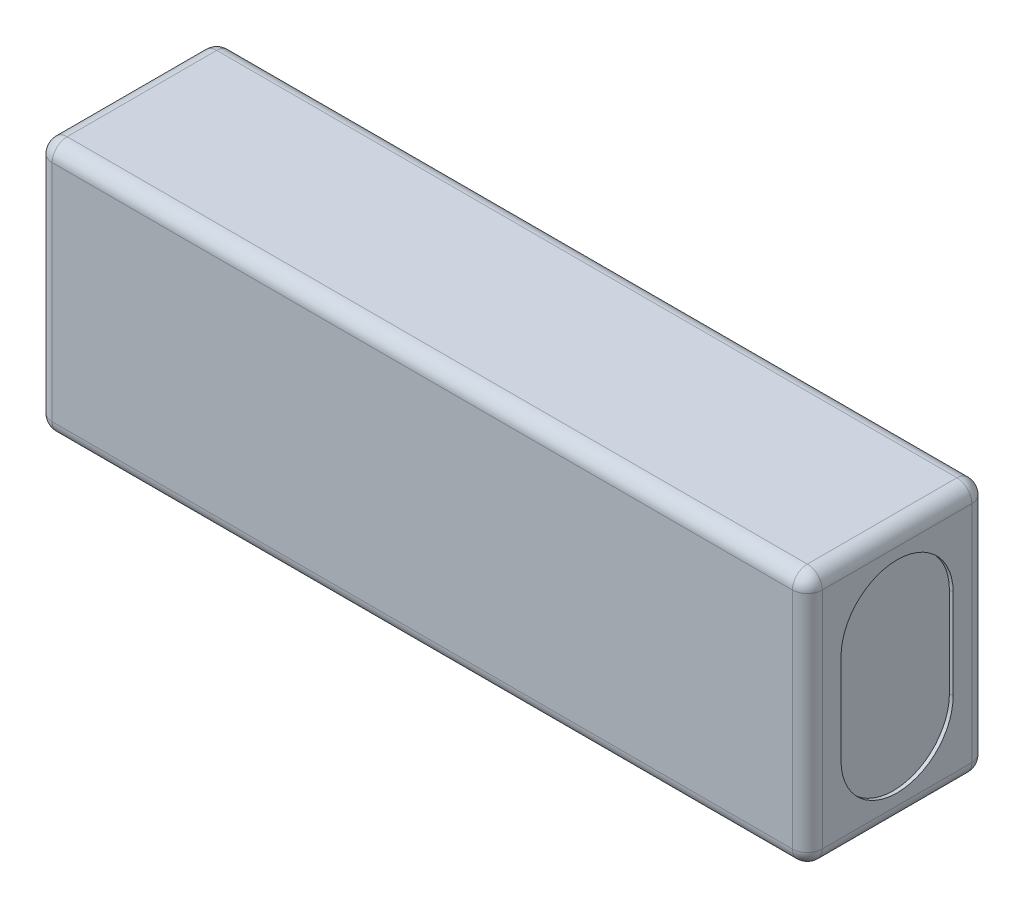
from build123d import *

# Parameters (mm, degrees)
ESBO_O1_W                = 103
ESBO_O1_H                = 34
RESSALTO_EXTRUS_O1_DEPTH = 24
CORTE_EXTRUS_O1_DEPTH    = 0.5
FILETE1_R                = 2


with BuildPart() as part:
    # Esbo_o1 → Ressalto-extrus_o1 (new body)
    with BuildSketch(Plane.XY):
        Rectangle(ESBO_O1_W, ESBO_O1_H)
    extrude(amount=RESSALTO_EXTRUS_O1_DEPTH)

    # Esbo_o2 → Corte-extrus_o1 (cut)
    with BuildSketch(Plane(origin=(51.5, 0, 0), x_dir=(0, 0, -1), z_dir=(1, 0, 0))):
        with BuildLine():
            Line((-4.5, 6), (-4.5, -6))
            ThreePointArc((-4.5, -6), (-12, -13.5), (-19.5, -6))
            Line((-19.5, -6), (-19.5, 6))
            ThreePointArc((-19.5, 6), (-12, 13.5), (-4.5, 6))
        make_face()
    corte_extrus_o1 = extrude(amount=-CORTE_EXTRUS_O1_DEPTH, mode=Mode.SUBTRACT)

    # Espelhar1: Corte-extrus_o1 across plane
    add(corte_extrus_o1.mirror(Plane(origin=(0, 0, 0), x_dir=(0, 0, 1), z_dir=(1, 0, 0))), mode=Mode.SUBTRACT)

    # Filete1
    filete1_edges = [part.edges().sort_by_distance(p)[0] for p in [
        (-51.5, 0, 24),
        (0, -17, 24),
        (51.5, 0, 24),
        (0, -17, 0),
        (-51.5, 0, 0),
        (0, 17, 0),
        (51.5, 0, 0),
        (0, 17, 24),
        (51.5, -17, 12),
        (-51.5, -17, 12),
        (-51.5, 17, 12),
        (51.5, 17, 12),
    ]]
    fillet(filete1_edges, radius=FILETE1_R)


solid = part.part
